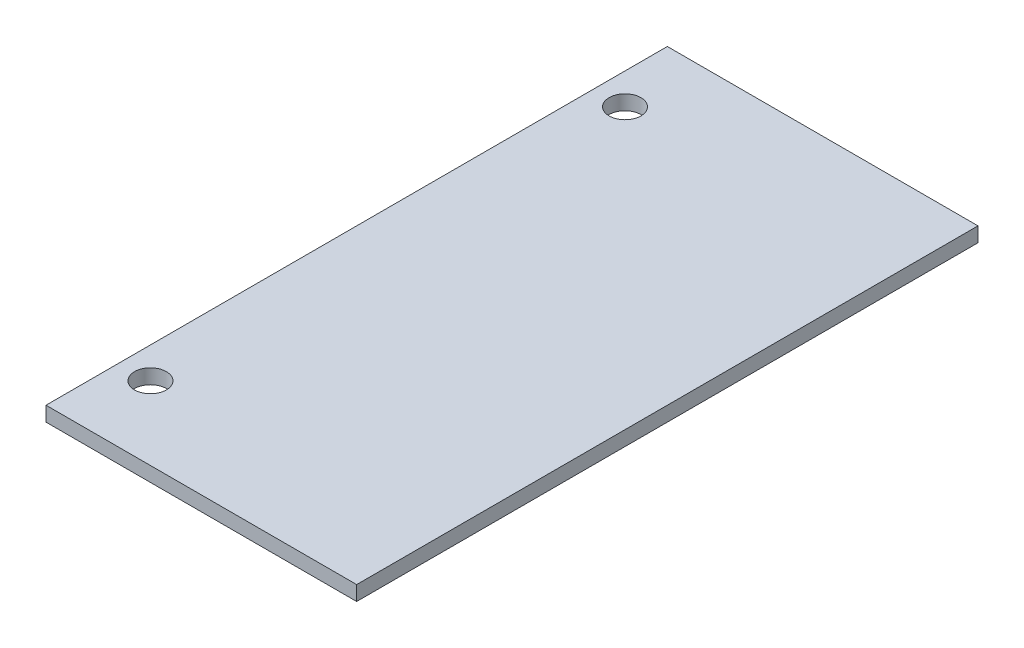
from build123d import *

# Parameters (mm, degrees)
SKETCH1_W          = 127
SKETCH1_H          = 254
EXTRUDE1_DEPTH     = 6
SKETCH2_R          = 6.5
CUT_EXTRUDE1_DEPTH = 143.11702924


with BuildPart() as part:
    # Sketch1 → Extrude1 (new body)
    with BuildSketch(Plane(origin=(0, 0, 0), x_dir=(1, 0, 0), z_dir=(0, 1, 0))):
        Rectangle(SKETCH1_W, SKETCH1_H)
    extrude(amount=EXTRUDE1_DEPTH)

    # Sketch2 → Cut-Extrude1 (cut, through all)
    with BuildSketch(Plane(origin=(0, 6, 0), x_dir=(1, 0, 0), z_dir=(0, 1, 0))):
        with Locations(Location((-50.8, -97, 0), (0, 0, 270))):
            Circle(SKETCH2_R)
        with Locations(Location((-50.8, 97, 0), (0, 0, 270))):
            Circle(SKETCH2_R)
    extrude(amount=-CUT_EXTRUDE1_DEPTH, mode=Mode.SUBTRACT)


solid = part.part
